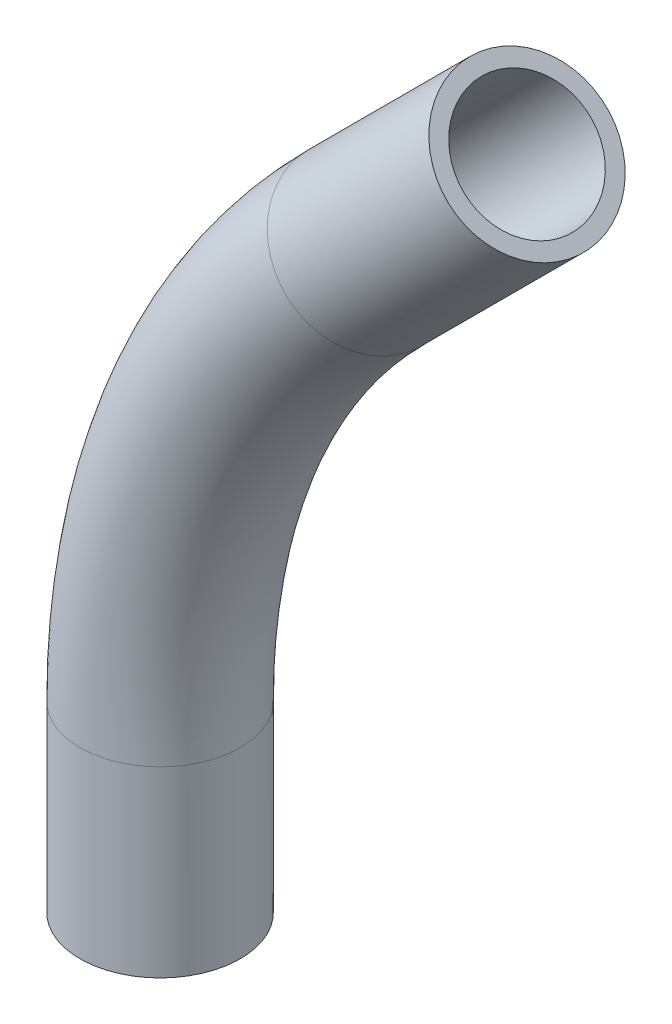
ISO-10303-21;
HEADER;
FILE_DESCRIPTION(('STEP AP214'),'2;1');
FILE_NAME('part.step','',(''),(''),'','','');
FILE_SCHEMA(('AUTOMOTIVE_DESIGN { 1 0 10303 214 1 1 1 1 }'));
ENDSEC;
DATA;
#1=APPLICATION_CONTEXT('core data for automotive mechanical design processes');
#2=APPLICATION_PROTOCOL_DEFINITION('international standard','automotive_design',2000,#1);
#3=PRODUCT_CONTEXT('',#1,'mechanical');
#4=PRODUCT('Part','Part','',(#3));
#5=PRODUCT_RELATED_PRODUCT_CATEGORY('part','',(#4));
#6=PRODUCT_DEFINITION_FORMATION('','',#4);
#7=PRODUCT_DEFINITION_CONTEXT('part definition',#1,'design');
#8=PRODUCT_DEFINITION('design','',#6,#7);
#9=PRODUCT_DEFINITION_SHAPE('','',#8);
#10=(LENGTH_UNIT() NAMED_UNIT(*) SI_UNIT(.MILLI.,.METRE.));
#11=(NAMED_UNIT(*) PLANE_ANGLE_UNIT() SI_UNIT($,.RADIAN.));
#12=(NAMED_UNIT(*) SI_UNIT($,.STERADIAN.) SOLID_ANGLE_UNIT());
#13=UNCERTAINTY_MEASURE_WITH_UNIT(LENGTH_MEASURE(1.E-05),#10,'distance_accuracy_value','');
#14=(GEOMETRIC_REPRESENTATION_CONTEXT(3) GLOBAL_UNCERTAINTY_ASSIGNED_CONTEXT((#13)) GLOBAL_UNIT_ASSIGNED_CONTEXT((#10,
#11,#12)) REPRESENTATION_CONTEXT('',''));
#15=CARTESIAN_POINT('',(0.,0.,0.));
#16=DIRECTION('',(0.,0.,1.));
#17=DIRECTION('',(1.,0.,0.));
#18=AXIS2_PLACEMENT_3D('',#15,#16,#17);
#19=CARTESIAN_POINT('',(0.,0.,0.));
#20=DIRECTION('',(0.,0.,1.));
#21=DIRECTION('',(1.,0.,0.));
#22=AXIS2_PLACEMENT_3D('',#19,#20,#21);
#23=TOROIDAL_SURFACE('',#22,146.05,16.7005);
#24=CARTESIAN_POINT('',(-103.272945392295,103.272945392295,0.));
#25=DIRECTION('',(0.707106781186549,0.707106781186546,0.));
#26=DIRECTION('',(0.,0.,1.));
#27=AXIS2_PLACEMENT_3D('',#24,#25,#26);
#28=CIRCLE('',#27,16.7005);
#29=CARTESIAN_POINT('',(-115.081982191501,115.081982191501,0.));
#30=VERTEX_POINT('',#29);
#31=EDGE_CURVE('E10',#30,#30,#28,.T.);
#32=CARTESIAN_POINT('',(-146.05,0.,0.));
#33=DIRECTION('',(0.,-1.,0.));
#34=DIRECTION('',(0.,0.,-1.));
#35=AXIS2_PLACEMENT_3D('',#32,#33,#34);
#36=CIRCLE('',#35,16.7005);
#37=CARTESIAN_POINT('',(-162.7505,0.,0.));
#38=VERTEX_POINT('',#37);
#39=EDGE_CURVE('E59',#38,#38,#36,.T.);
#40=CARTESIAN_POINT('',(0.,0.,0.));
#41=DIRECTION('',(0.,0.,1.));
#42=DIRECTION('',(1.,0.,0.));
#43=AXIS2_PLACEMENT_3D('',#40,#41,#42);
#44=CIRCLE('',#43,162.7505);
#45=EDGE_CURVE('',#30,#38,#44,.T.);
#46=ORIENTED_EDGE('',*,*,#31,.F.);
#47=ORIENTED_EDGE('',*,*,#39,.F.);
#48=ORIENTED_EDGE('',*,*,#45,.T.);
#49=ORIENTED_EDGE('',*,*,#45,.F.);
#50=EDGE_LOOP('',(#46,#48,#47,#49));
#51=FACE_BOUND('',#50,.T.);
#52=ADVANCED_FACE('F34',(#51),#23,.T.);
#53=CARTESIAN_POINT('',(0.,0.,0.));
#54=DIRECTION('',(0.,0.,1.));
#55=DIRECTION('',(1.,0.,0.));
#56=AXIS2_PLACEMENT_3D('',#53,#54,#55);
#57=TOROIDAL_SURFACE('',#56,146.05,13.3223);
#58=CARTESIAN_POINT('',(-103.272945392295,103.272945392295,0.));
#59=DIRECTION('',(0.707106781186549,0.707106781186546,0.));
#60=DIRECTION('',(-0.707106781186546,0.707106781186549,0.));
#61=AXIS2_PLACEMENT_3D('',#58,#59,#60);
#62=CIRCLE('',#61,13.3223);
#63=CARTESIAN_POINT('',(-112.693234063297,112.693234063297,0.));
#64=VERTEX_POINT('',#63);
#65=EDGE_CURVE('E53',#64,#64,#62,.T.);
#66=CARTESIAN_POINT('',(-146.05,0.,0.));
#67=DIRECTION('',(0.,1.,0.));
#68=DIRECTION('',(0.,0.,1.));
#69=AXIS2_PLACEMENT_3D('',#66,#67,#68);
#70=CIRCLE('',#69,13.3223);
#71=CARTESIAN_POINT('',(-159.3723,0.,0.));
#72=VERTEX_POINT('',#71);
#73=EDGE_CURVE('E40',#72,#72,#70,.T.);
#74=CARTESIAN_POINT('',(0.,0.,0.));
#75=DIRECTION('',(0.,0.,1.));
#76=DIRECTION('',(1.,0.,0.));
#77=AXIS2_PLACEMENT_3D('',#74,#75,#76);
#78=CIRCLE('',#77,159.3723);
#79=EDGE_CURVE('',#64,#72,#78,.T.);
#80=ORIENTED_EDGE('',*,*,#65,.T.);
#81=ORIENTED_EDGE('',*,*,#73,.F.);
#82=ORIENTED_EDGE('',*,*,#79,.T.);
#83=ORIENTED_EDGE('',*,*,#79,.F.);
#84=EDGE_LOOP('',(#80,#82,#81,#83));
#85=FACE_BOUND('',#84,.T.);
#86=ADVANCED_FACE('F85',(#85),#57,.F.);
#87=CARTESIAN_POINT('',(-69.5969849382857,136.948905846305,0.));
#88=DIRECTION('',(0.707106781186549,0.707106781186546,0.));
#89=DIRECTION('',(-0.707106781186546,0.707106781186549,0.));
#90=AXIS2_PLACEMENT_3D('',#87,#88,#89);
#91=PLANE('',#90);
#92=CARTESIAN_POINT('',(-69.5969849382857,136.948905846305,0.));
#93=DIRECTION('',(0.707106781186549,0.707106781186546,0.));
#94=DIRECTION('',(-0.707106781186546,0.707106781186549,0.));
#95=AXIS2_PLACEMENT_3D('',#92,#93,#94);
#96=CIRCLE('',#95,16.7005);
#97=CARTESIAN_POINT('',(-81.4060217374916,148.757942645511,0.));
#98=VERTEX_POINT('',#97);
#99=EDGE_CURVE('E44',#98,#98,#96,.T.);
#100=ORIENTED_EDGE('',*,*,#99,.T.);
#101=EDGE_LOOP('',(#100));
#102=FACE_BOUND('',#101,.T.);
#103=CARTESIAN_POINT('',(-69.5969849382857,136.948905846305,0.));
#104=DIRECTION('',(0.707106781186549,0.707106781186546,0.));
#105=DIRECTION('',(-0.707106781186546,0.707106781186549,0.));
#106=AXIS2_PLACEMENT_3D('',#103,#104,#105);
#107=CIRCLE('',#106,13.3223);
#108=CARTESIAN_POINT('',(-79.0172736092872,146.369194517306,0.));
#109=VERTEX_POINT('',#108);
#110=EDGE_CURVE('E48',#109,#109,#107,.T.);
#111=ORIENTED_EDGE('',*,*,#110,.F.);
#112=EDGE_LOOP('',(#111));
#113=FACE_BOUND('',#112,.T.);
#114=ADVANCED_FACE('F90',(#102,#113),#91,.T.);
#115=CARTESIAN_POINT('',(-69.5969849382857,136.948905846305,0.));
#116=DIRECTION('',(-0.707106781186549,-0.707106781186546,0.));
#117=DIRECTION('',(0.707106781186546,-0.707106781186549,0.));
#118=AXIS2_PLACEMENT_3D('',#115,#116,#117);
#119=CYLINDRICAL_SURFACE('',#118,16.7005);
#120=ORIENTED_EDGE('',*,*,#99,.F.);
#121=EDGE_LOOP('',(#120));
#122=FACE_BOUND('',#121,.T.);
#123=ORIENTED_EDGE('',*,*,#31,.T.);
#124=EDGE_LOOP('',(#123));
#125=FACE_BOUND('',#124,.T.);
#126=ADVANCED_FACE('F80',(#122,#125),#119,.T.);
#127=CARTESIAN_POINT('',(-69.5969849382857,136.948905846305,0.));
#128=DIRECTION('',(-0.707106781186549,-0.707106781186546,0.));
#129=DIRECTION('',(0.707106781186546,-0.707106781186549,0.));
#130=AXIS2_PLACEMENT_3D('',#127,#128,#129);
#131=CYLINDRICAL_SURFACE('',#130,13.3223);
#132=ORIENTED_EDGE('',*,*,#110,.T.);
#133=EDGE_LOOP('',(#132));
#134=FACE_BOUND('',#133,.T.);
#135=ORIENTED_EDGE('',*,*,#65,.F.);
#136=EDGE_LOOP('',(#135));
#137=FACE_BOUND('',#136,.T.);
#138=ADVANCED_FACE('F71',(#134,#137),#131,.F.);
#139=CARTESIAN_POINT('',(-146.05,-38.1,0.));
#140=DIRECTION('',(0.,-1.,0.));
#141=DIRECTION('',(0.,0.,-1.));
#142=AXIS2_PLACEMENT_3D('',#139,#140,#141);
#143=PLANE('',#142);
#144=CARTESIAN_POINT('',(-146.05,-38.1,0.));
#145=DIRECTION('',(0.,-1.,0.));
#146=DIRECTION('',(0.,0.,-1.));
#147=AXIS2_PLACEMENT_3D('',#144,#145,#146);
#148=CIRCLE('',#147,16.7005);
#149=CARTESIAN_POINT('',(-146.05,-38.1,-16.7005));
#150=VERTEX_POINT('',#149);
#151=EDGE_CURVE('E56',#150,#150,#148,.T.);
#152=ORIENTED_EDGE('',*,*,#151,.T.);
#153=EDGE_LOOP('',(#152));
#154=FACE_BOUND('',#153,.T.);
#155=CARTESIAN_POINT('',(-146.05,-38.1,0.));
#156=DIRECTION('',(0.,-1.,0.));
#157=DIRECTION('',(0.,0.,-1.));
#158=AXIS2_PLACEMENT_3D('',#155,#156,#157);
#159=CIRCLE('',#158,13.3223);
#160=CARTESIAN_POINT('',(-146.05,-38.1,-13.3223));
#161=VERTEX_POINT('',#160);
#162=EDGE_CURVE('E62',#161,#161,#159,.T.);
#163=ORIENTED_EDGE('',*,*,#162,.F.);
#164=EDGE_LOOP('',(#163));
#165=FACE_BOUND('',#164,.T.);
#166=ADVANCED_FACE('F68',(#154,#165),#143,.T.);
#167=CARTESIAN_POINT('',(-146.05,-38.1,0.));
#168=DIRECTION('',(0.,1.,0.));
#169=DIRECTION('',(0.,0.,1.));
#170=AXIS2_PLACEMENT_3D('',#167,#168,#169);
#171=CYLINDRICAL_SURFACE('',#170,16.7005);
#172=ORIENTED_EDGE('',*,*,#151,.F.);
#173=EDGE_LOOP('',(#172));
#174=FACE_BOUND('',#173,.T.);
#175=ORIENTED_EDGE('',*,*,#39,.T.);
#176=EDGE_LOOP('',(#175));
#177=FACE_BOUND('',#176,.T.);
#178=ADVANCED_FACE('F70',(#174,#177),#171,.T.);
#179=CARTESIAN_POINT('',(-146.05,-38.1,0.));
#180=DIRECTION('',(0.,1.,0.));
#181=DIRECTION('',(0.,0.,1.));
#182=AXIS2_PLACEMENT_3D('',#179,#180,#181);
#183=CYLINDRICAL_SURFACE('',#182,13.3223);
#184=ORIENTED_EDGE('',*,*,#162,.T.);
#185=EDGE_LOOP('',(#184));
#186=FACE_BOUND('',#185,.T.);
#187=ORIENTED_EDGE('',*,*,#73,.T.);
#188=EDGE_LOOP('',(#187));
#189=FACE_BOUND('',#188,.T.);
#190=ADVANCED_FACE('F66',(#186,#189),#183,.F.);
#191=CLOSED_SHELL('',(#52,#86,#114,#126,#138,#166,#178,#190));
#192=MANIFOLD_SOLID_BREP('B2',#191);
#193=ADVANCED_BREP_SHAPE_REPRESENTATION('',(#18,#192),#14);
#194=SHAPE_DEFINITION_REPRESENTATION(#9,#193);
ENDSEC;
END-ISO-10303-21;
